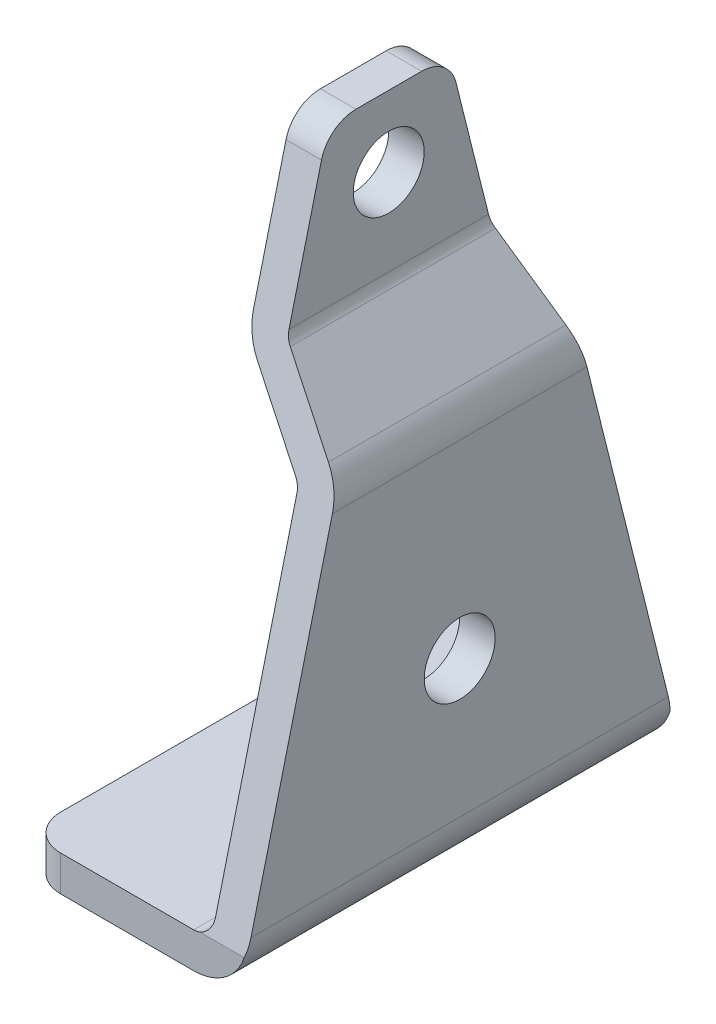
from build123d import *

# Parameters (mm, degrees)
BASE_EXTRUSION_DEPTH    = 48
ENL_V_MAT_EXTRU_1_DEPTH = 91.873538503
CONG_5_R                = 4
ESQUISSE3_R             = 4
ENL_V_MAT_EXTRU_2_DEPTH = 89.328930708
ESQUISSE4_R             = 4
ENL_V_MAT_EXTRU_4_DEPTH = 91.873538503


with BuildPart() as part:
    # Esquisse1 → Base-Extrusion (new body)
    with BuildSketch(Plane.XY):
        with BuildLine():
            Line((0, 0), (19, 0))
            ThreePointArc((19, 0), (23.242640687, 1.757359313), (25, 6))
            Line((25, 6), (25, 42.816178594))
            ThreePointArc((25, 42.816178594), (24.638155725, 44.868299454), (23.596266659, 46.672904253))
            Line((23.596266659, 46.672904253), (17.467911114, 53.97639399))
            ThreePointArc((17.467911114, 53.97639399), (17.120614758, 54.577928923), (17, 55.261969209))
            Line((17, 55.261969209), (17, 73))
            Line((17, 73), (13, 73))
            Line((13, 73), (13, 55.261969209))
            ThreePointArc((13, 55.261969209), (13.361844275, 53.209848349), (14.403733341, 51.405243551))
            Line((14.403733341, 51.405243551), (20.532088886, 44.101753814))
            ThreePointArc((20.532088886, 44.101753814), (20.879385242, 43.500218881), (21, 42.816178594))
            Line((21, 42.816178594), (21, 6))
            ThreePointArc((21, 6), (20.414213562, 4.585786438), (19, 4))
            Line((19, 4), (0, 4))
            Line((0, 4), (0, 0))
        make_face()
    extrude(amount=BASE_EXTRUSION_DEPTH)

    # Esquisse2 → Enl_v. mat.-Extru.1 (cut, through all)
    with BuildSketch(Plane(origin=(25, 0, 0), x_dir=(0, 0, -1), z_dir=(1, 0, 0))):
        Polygon((-48, 4.133586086), (-30.829674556, 73), (-48, 73), align=None)
        Polygon((0, 4.133586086), (-17.170325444, 73), (0, 73), align=None)
    extrude(amount=-ENL_V_MAT_EXTRU_1_DEPTH, mode=Mode.SUBTRACT)

    # Cong_5
    cong_5_edges = [part.edges().sort_by_distance(p)[0] for p in [
        (15, 73, 17.170325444),
        (15, 73, 30.829674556),
        (0, 2, 0),
        (0, 2, 48),
    ]]
    fillet(cong_5_edges, radius=CONG_5_R)

    # Esquisse3 → Enl_v. mat.-Extru.2 (cut, through all)
    with BuildSketch(Plane.ZY.offset(-13)):
        with Locations(Location((24, 65, 0), (0, 0, 270))):
            Circle(ESQUISSE3_R)
    extrude(amount=-ENL_V_MAT_EXTRU_2_DEPTH, mode=Mode.SUBTRACT)

    # Esquisse4 → Enl_v. mat.-Extru.4 (cut, through all)
    with BuildSketch(Plane(origin=(25, 0, 0), x_dir=(0, 0, -1), z_dir=(1, 0, 0))):
        with Locations((-24, 21.5)):
            Circle(ESQUISSE4_R)
    extrude(amount=-ENL_V_MAT_EXTRU_4_DEPTH, mode=Mode.SUBTRACT)


solid = part.part
